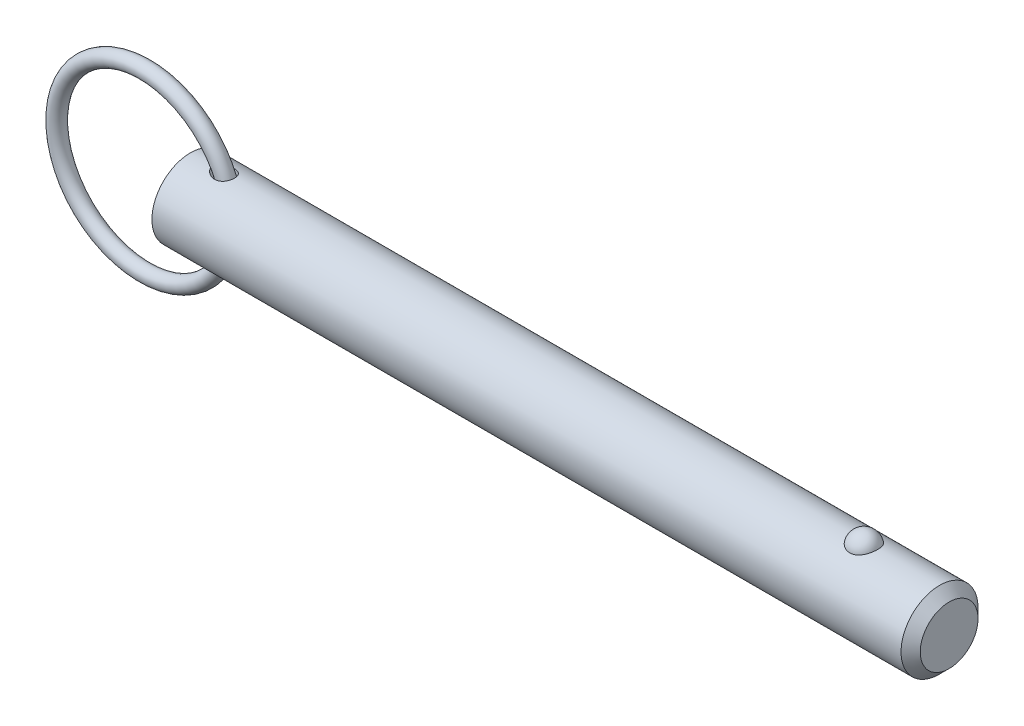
ISO-10303-21;
HEADER;
FILE_DESCRIPTION(('STEP AP214'),'2;1');
FILE_NAME('part.step','',(''),(''),'','','');
FILE_SCHEMA(('AUTOMOTIVE_DESIGN { 1 0 10303 214 1 1 1 1 }'));
ENDSEC;
DATA;
#1=APPLICATION_CONTEXT('core data for automotive mechanical design processes');
#2=APPLICATION_PROTOCOL_DEFINITION('international standard','automotive_design',2000,#1);
#3=PRODUCT_CONTEXT('',#1,'mechanical');
#4=PRODUCT('Part','Part','',(#3));
#5=PRODUCT_RELATED_PRODUCT_CATEGORY('part','',(#4));
#6=PRODUCT_DEFINITION_FORMATION('','',#4);
#7=PRODUCT_DEFINITION_CONTEXT('part definition',#1,'design');
#8=PRODUCT_DEFINITION('design','',#6,#7);
#9=PRODUCT_DEFINITION_SHAPE('','',#8);
#10=(LENGTH_UNIT() NAMED_UNIT(*) SI_UNIT(.MILLI.,.METRE.));
#11=(NAMED_UNIT(*) PLANE_ANGLE_UNIT() SI_UNIT($,.RADIAN.));
#12=(NAMED_UNIT(*) SI_UNIT($,.STERADIAN.) SOLID_ANGLE_UNIT());
#13=UNCERTAINTY_MEASURE_WITH_UNIT(LENGTH_MEASURE(1.E-05),#10,'distance_accuracy_value','');
#14=(GEOMETRIC_REPRESENTATION_CONTEXT(3) GLOBAL_UNCERTAINTY_ASSIGNED_CONTEXT((#13)) GLOBAL_UNIT_ASSIGNED_CONTEXT((#10,
#11,#12)) REPRESENTATION_CONTEXT('',''));
#15=CARTESIAN_POINT('',(0.,0.,0.));
#16=DIRECTION('',(0.,0.,1.));
#17=DIRECTION('',(1.,0.,0.));
#18=AXIS2_PLACEMENT_3D('',#15,#16,#17);
#19=CARTESIAN_POINT('',(-6.5973878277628,0.,0.));
#20=DIRECTION('',(0.,0.,1.));
#21=DIRECTION('',(1.,0.,0.));
#22=AXIS2_PLACEMENT_3D('',#19,#20,#21);
#23=TOROIDAL_SURFACE('',#22,12.7,1.111);
#24=CARTESIAN_POINT('',(7.21361217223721,0.,0.));
#25=VERTEX_POINT('',#24);
#26=VERTEX_LOOP('',#25);
#27=FACE_BOUND('',#26,.T.);
#28=ADVANCED_FACE('P0_F12',(#27),#23,.T.);
#29=CLOSED_SHELL('',(#28));
#30=MANIFOLD_SOLID_BREP('P0_B1',#29);
#31=CARTESIAN_POINT('',(0.,0.,0.));
#32=DIRECTION('',(1.,0.,0.));
#33=DIRECTION('',(0.,0.,-1.));
#34=AXIS2_PLACEMENT_3D('',#31,#32,#33);
#35=CYLINDRICAL_SURFACE('',#34,5.555);
#36=CARTESIAN_POINT('',(3.4079629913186,5.52646850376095,-0.56229074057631));
#37=CARTESIAN_POINT('',(3.45038002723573,5.51879026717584,-0.637753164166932));
#38=CARTESIAN_POINT('',(3.50032814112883,5.50998541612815,-0.70889136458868));
#39=CARTESIAN_POINT('',(3.61174203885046,5.49132550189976,-0.841353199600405));
#40=CARTESIAN_POINT('',(3.67323300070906,5.48146816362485,-0.902654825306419));
#41=CARTESIAN_POINT('',(3.80437942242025,5.46186986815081,-1.01449227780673));
#42=CARTESIAN_POINT('',(3.87396236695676,5.45212862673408,-1.06511378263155));
#43=CARTESIAN_POINT('',(4.01965973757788,5.43359578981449,-1.15594541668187));
#44=CARTESIAN_POINT('',(4.09577226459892,5.42480391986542,-1.19615855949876));
#45=CARTESIAN_POINT('',(4.26620236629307,5.40764958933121,-1.27165209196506));
#46=CARTESIAN_POINT('',(4.36143030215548,5.3996073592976,-1.30496908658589));
#47=CARTESIAN_POINT('',(4.55632904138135,5.38707461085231,-1.35578120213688));
#48=CARTESIAN_POINT('',(4.65600230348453,5.38258608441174,-1.37326745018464));
#49=CARTESIAN_POINT('',(4.85802759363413,5.37803111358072,-1.3910078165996));
#50=CARTESIAN_POINT('',(4.96039620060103,5.37800782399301,-1.39109376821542));
#51=CARTESIAN_POINT('',(5.16321961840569,5.38288845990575,-1.37209481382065));
#52=CARTESIAN_POINT('',(5.26367660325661,5.38778639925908,-1.3530331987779));
#53=CARTESIAN_POINT('',(5.44616808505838,5.40112654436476,-1.29866014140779));
#54=CARTESIAN_POINT('',(5.52893514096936,5.40904875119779,-1.26567968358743));
#55=CARTESIAN_POINT('',(5.68656142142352,5.4273273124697,-1.18484144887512));
#56=CARTESIAN_POINT('',(5.76142575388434,5.43768208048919,-1.13699336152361));
#57=CARTESIAN_POINT('',(5.8928378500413,5.45821422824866,-1.03362464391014));
#58=CARTESIAN_POINT('',(5.95048930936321,5.4682911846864,-0.979480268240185));
#59=CARTESIAN_POINT('',(6.05543937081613,5.48805232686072,-0.861887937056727));
#60=CARTESIAN_POINT('',(6.10274018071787,5.4977365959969,-0.798441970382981));
#61=CARTESIAN_POINT('',(6.18429732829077,5.51527779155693,-0.666351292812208));
#62=CARTESIAN_POINT('',(6.21893047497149,5.52318421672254,-0.597945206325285));
#63=CARTESIAN_POINT('',(6.27643902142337,5.53669785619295,-0.456146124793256));
#64=CARTESIAN_POINT('',(6.299314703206,5.54230512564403,-0.382753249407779));
#65=CARTESIAN_POINT('',(6.33280284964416,5.55061821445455,-0.232999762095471));
#66=CARTESIAN_POINT('',(6.34340498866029,5.55332159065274,-0.156636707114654));
#67=CARTESIAN_POINT('',(6.35208224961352,5.55552923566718,-0.00315477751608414));
#68=CARTESIAN_POINT('',(6.3501570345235,5.55503341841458,0.0739641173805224));
#69=CARTESIAN_POINT('',(6.33379320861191,5.55088854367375,0.22702996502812));
#70=CARTESIAN_POINT('',(6.31931424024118,5.54722931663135,0.302972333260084));
#71=CARTESIAN_POINT('',(6.27810810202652,5.53713917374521,0.451265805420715));
#72=CARTESIAN_POINT('',(6.25138106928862,5.53070828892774,0.523616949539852));
#73=CARTESIAN_POINT('',(6.18634700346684,5.51578851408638,0.662556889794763));
#74=CARTESIAN_POINT('',(6.14805666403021,5.50730259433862,0.729153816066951));
#75=CARTESIAN_POINT('',(6.0608417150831,5.4892059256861,0.854797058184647));
#76=CARTESIAN_POINT('',(6.01191805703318,5.47959527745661,0.91384404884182));
#77=CARTESIAN_POINT('',(5.90496974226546,5.46035411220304,1.0225462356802));
#78=CARTESIAN_POINT('',(5.8469816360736,5.45072382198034,1.07223745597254));
#79=CARTESIAN_POINT('',(5.72342907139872,5.43245016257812,1.16128533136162));
#80=CARTESIAN_POINT('',(5.65786492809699,5.42380675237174,1.20064241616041));
#81=CARTESIAN_POINT('',(5.52033184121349,5.40830592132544,1.26865612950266));
#82=CARTESIAN_POINT('',(5.44830127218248,5.40146883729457,1.29719236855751));
#83=CARTESIAN_POINT('',(5.30051649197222,5.39032432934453,1.34275086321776));
#84=CARTESIAN_POINT('',(5.22476137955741,5.38601752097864,1.35977031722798));
#85=CARTESIAN_POINT('',(5.06697568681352,5.38004503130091,1.3832203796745));
#86=CARTESIAN_POINT('',(4.98483834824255,5.37854992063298,1.38896799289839));
#87=CARTESIAN_POINT('',(4.82062075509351,5.37866467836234,1.38851901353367));
#88=CARTESIAN_POINT('',(4.73854053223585,5.38027567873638,1.38231806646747));
#89=CARTESIAN_POINT('',(4.5665970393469,5.38661928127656,1.35740374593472));
#90=CARTESIAN_POINT('',(4.47694676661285,5.39169506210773,1.33731128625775));
#91=CARTESIAN_POINT('',(4.30168169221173,5.40457769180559,1.28425210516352));
#92=CARTESIAN_POINT('',(4.2160714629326,5.41238755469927,1.25127117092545));
#93=CARTESIAN_POINT('',(4.04117722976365,5.43085841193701,1.16867508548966));
#94=CARTESIAN_POINT('',(3.95261220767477,5.44174460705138,1.11757796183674));
#95=CARTESIAN_POINT('',(3.78568183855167,5.46440376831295,1.00091858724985));
#96=CARTESIAN_POINT('',(3.70730710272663,5.47617590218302,0.935369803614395));
#97=CARTESIAN_POINT('',(3.5829937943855,5.49603821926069,0.809043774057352));
#98=CARTESIAN_POINT('',(3.5339020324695,5.50429522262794,0.751392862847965));
#99=CARTESIAN_POINT('',(3.44556991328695,5.51963490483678,0.628847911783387));
#100=CARTESIAN_POINT('',(3.40631385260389,5.52671944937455,0.563965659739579));
#101=CARTESIAN_POINT('',(3.34553998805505,5.5379053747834,0.439181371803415));
#102=CARTESIAN_POINT('',(3.32216705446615,5.5423057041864,0.380214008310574));
#103=CARTESIAN_POINT('',(3.2854368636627,5.54928356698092,0.259119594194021));
#104=CARTESIAN_POINT('',(3.27207322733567,5.5518622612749,0.196994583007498));
#105=CARTESIAN_POINT('',(3.25633559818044,5.5549036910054,0.0710541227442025));
#106=CARTESIAN_POINT('',(3.25400356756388,5.5553583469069,0.00723314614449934));
#107=CARTESIAN_POINT('',(3.26064251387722,5.55407150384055,-0.119787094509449));
#108=CARTESIAN_POINT('',(3.26961302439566,5.55233009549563,-0.182986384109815));
#109=CARTESIAN_POINT('',(3.29666795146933,5.54714559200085,-0.30051820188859));
#110=CARTESIAN_POINT('',(3.31373453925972,5.54389322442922,-0.355099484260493));
#111=CARTESIAN_POINT('',(3.35543396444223,5.53607951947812,-0.461174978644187));
#112=CARTESIAN_POINT('',(3.38007019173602,5.5315175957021,-0.512667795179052));
#113=CARTESIAN_POINT('',(3.4079629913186,5.52646850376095,-0.56229074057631));
#114=B_SPLINE_CURVE_WITH_KNOTS('',3,(#36,#37,#38,#39,#40,#41,#42,#43,#44,#45,#46,#47,#48,#49,
#50,#51,#52,#53,#54,#55,#56,#57,#58,#59,#60,#61,#62,#63,#64,#65,#66,#67,#68,#69,#70,#71,#72,#73,
#74,#75,#76,#77,#78,#79,#80,#81,#82,#83,#84,#85,#86,#87,#88,#89,#90,#91,#92,#93,#94,#95,#96,#97,
#98,#99,#100,#101,#102,#103,#104,#105,#106,#107,#108,#109,#110,#111,#112,#113),.UNSPECIFIED.,
.T.,.F.,(4,2,2,2,2,2,2,2,2,2,2,2,2,2,2,2,2,2,2,2,2,2,2,2,2,2,2,2,2,2,2,2,2,2,2,2,2,2,4),(0.,
0.260459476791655,0.521493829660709,0.780346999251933,1.03912513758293,1.34137402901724,
1.64379222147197,1.94913302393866,2.25410286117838,2.52092363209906,2.78757087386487,
3.0255756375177,3.26352958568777,3.49368251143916,3.72382991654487,3.9541708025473,
4.18451788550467,4.41560824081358,4.64669600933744,4.87745174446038,5.10818684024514,
5.33801446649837,5.56783253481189,5.80013729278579,6.03249854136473,6.27855081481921,
6.5246927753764,6.79963372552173,7.07487872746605,7.38193573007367,7.68870779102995,
7.91639390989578,8.14371416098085,8.33366541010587,8.52349549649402,8.71404708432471,
8.90459080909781,9.07578823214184,9.24706243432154),.UNSPECIFIED.);
#115=CARTESIAN_POINT('',(3.4079629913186,5.52646850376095,-0.56229074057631));
#116=VERTEX_POINT('',#115);
#117=EDGE_CURVE('P1_E40',#116,#116,#114,.T.);
#118=ORIENTED_EDGE('',*,*,#117,.T.);
#119=EDGE_LOOP('',(#118));
#120=FACE_BOUND('',#119,.T.);
#121=CARTESIAN_POINT('',(108.13125,0.,0.));
#122=DIRECTION('',(1.,0.,0.));
#123=DIRECTION('',(0.,0.,-1.));
#124=AXIS2_PLACEMENT_3D('',#121,#122,#123);
#125=CIRCLE('',#124,5.555);
#126=CARTESIAN_POINT('',(108.13125,0.,-5.555));
#127=VERTEX_POINT('',#126);
#128=EDGE_CURVE('P1_E25',#127,#127,#125,.T.);
#129=ORIENTED_EDGE('',*,*,#128,.F.);
#130=EDGE_LOOP('',(#129));
#131=FACE_BOUND('',#130,.T.);
#132=CARTESIAN_POINT('',(0.,0.,0.));
#133=DIRECTION('',(1.,0.,0.));
#134=DIRECTION('',(0.,0.,-1.));
#135=AXIS2_PLACEMENT_3D('',#132,#133,#134);
#136=CIRCLE('',#135,5.555);
#137=CARTESIAN_POINT('',(0.,0.,-5.555));
#138=VERTEX_POINT('',#137);
#139=EDGE_CURVE('P1_E9',#138,#138,#136,.T.);
#140=ORIENTED_EDGE('',*,*,#139,.T.);
#141=EDGE_LOOP('',(#140));
#142=FACE_BOUND('',#141,.T.);
#143=CARTESIAN_POINT('',(97.2186264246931,5.16741224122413,2.03859650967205));
#144=CARTESIAN_POINT('',(97.1129492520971,5.16740893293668,2.03859990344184));
#145=CARTESIAN_POINT('',(97.00729894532,5.17079470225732,2.03008306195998));
#146=CARTESIAN_POINT('',(96.7991419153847,5.18392795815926,1.9963072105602));
#147=CARTESIAN_POINT('',(96.6966344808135,5.19367399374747,1.9710520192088));
#148=CARTESIAN_POINT('',(96.4977710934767,5.21839168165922,1.90463997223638));
#149=CARTESIAN_POINT('',(96.4014064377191,5.23335573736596,1.86350622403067));
#150=CARTESIAN_POINT('',(96.2170804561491,5.26688076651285,1.76652592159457));
#151=CARTESIAN_POINT('',(96.1291207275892,5.28544242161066,1.71067657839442));
#152=CARTESIAN_POINT('',(95.9612654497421,5.32479845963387,1.58399959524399));
#153=CARTESIAN_POINT('',(95.8816656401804,5.34564089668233,1.51279545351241));
#154=CARTESIAN_POINT('',(95.7351290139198,5.38697258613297,1.35828584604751));
#155=CARTESIAN_POINT('',(95.668194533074,5.40746177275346,1.27497815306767));
#156=CARTESIAN_POINT('',(95.5456103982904,5.44694508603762,1.09440293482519));
#157=CARTESIAN_POINT('',(95.4905989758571,5.46583143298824,0.99667783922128));
#158=CARTESIAN_POINT('',(95.3969376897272,5.49908030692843,0.792961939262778));
#159=CARTESIAN_POINT('',(95.3582894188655,5.513442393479,0.686970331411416));
#160=CARTESIAN_POINT('',(95.2976807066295,5.536358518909,0.468019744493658));
#161=CARTESIAN_POINT('',(95.2759725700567,5.54482455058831,0.35498154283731));
#162=CARTESIAN_POINT('',(95.2506362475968,5.55473324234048,0.126595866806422));
#163=CARTESIAN_POINT('',(95.2470077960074,5.55617600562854,0.0112484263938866));
#164=CARTESIAN_POINT('',(95.2578817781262,5.55189984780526,-0.218011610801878));
#165=CARTESIAN_POINT('',(95.2723151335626,5.54620821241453,-0.331928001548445));
#166=CARTESIAN_POINT('',(95.318903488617,5.52828920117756,-0.555544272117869));
#167=CARTESIAN_POINT('',(95.3510588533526,5.5160616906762,-0.665244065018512));
#168=CARTESIAN_POINT('',(95.4324883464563,5.48630779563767,-0.877469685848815));
#169=CARTESIAN_POINT('',(95.4817816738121,5.4687754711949,-0.979987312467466));
#170=CARTESIAN_POINT('',(95.5964785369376,5.43024700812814,-1.17486975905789));
#171=CARTESIAN_POINT('',(95.6618831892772,5.4092506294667,-1.26723387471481));
#172=CARTESIAN_POINT('',(95.8075712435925,5.36600927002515,-1.43940133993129));
#173=CARTESIAN_POINT('',(95.8878859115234,5.34376173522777,-1.5191776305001));
#174=CARTESIAN_POINT('',(96.0614520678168,5.30057971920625,-1.66360338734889));
#175=CARTESIAN_POINT('',(96.1547021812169,5.27964509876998,-1.72825445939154));
#176=CARTESIAN_POINT('',(96.3493939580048,5.24205250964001,-1.8390947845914));
#177=CARTESIAN_POINT('',(96.4505900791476,5.22530519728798,-1.88568407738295));
#178=CARTESIAN_POINT('',(96.6601552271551,5.19750919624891,-1.96100802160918));
#179=CARTESIAN_POINT('',(96.7685215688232,5.18645838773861,-1.98974931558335));
#180=CARTESIAN_POINT('',(96.9834989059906,5.17184410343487,-2.02742262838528));
#181=CARTESIAN_POINT('',(97.089925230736,5.16793282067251,-2.0372760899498));
#182=CARTESIAN_POINT('',(97.3029925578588,5.1669899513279,-2.03966777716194));
#183=CARTESIAN_POINT('',(97.4096335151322,5.16995704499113,-2.03220932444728));
#184=CARTESIAN_POINT('',(97.6167730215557,5.18222383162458,-2.0007117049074));
#185=CARTESIAN_POINT('',(97.7173599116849,5.19133213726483,-1.97717337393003));
#186=CARTESIAN_POINT('',(97.9130141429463,5.21467637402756,-1.91475248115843));
#187=CARTESIAN_POINT('',(98.0080810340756,5.22891272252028,-1.8758686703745));
#188=CARTESIAN_POINT('',(98.1923711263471,5.26137066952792,-1.78282713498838));
#189=CARTESIAN_POINT('',(98.2814190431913,5.27967329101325,-1.7283512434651));
#190=CARTESIAN_POINT('',(98.4492880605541,5.31817411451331,-1.60597483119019));
#191=CARTESIAN_POINT('',(98.5281068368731,5.33837274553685,-1.53807126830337));
#192=CARTESIAN_POINT('',(98.6775156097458,5.37968287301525,-1.38688970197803));
#193=CARTESIAN_POINT('',(98.7475058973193,5.40079011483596,-1.30301744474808));
#194=CARTESIAN_POINT('',(98.8730125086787,5.44074401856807,-1.12458170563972));
#195=CARTESIAN_POINT('',(98.9285262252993,5.4595902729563,-1.03001630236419));
#196=CARTESIAN_POINT('',(99.0255507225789,5.49369849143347,-0.829439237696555));
#197=CARTESIAN_POINT('',(99.0665483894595,5.50882422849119,-0.723155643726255));
#198=CARTESIAN_POINT('',(99.1311250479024,5.53310911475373,-0.504772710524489));
#199=CARTESIAN_POINT('',(99.1547036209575,5.54226812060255,-0.392673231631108));
#200=CARTESIAN_POINT('',(99.184013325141,5.55370358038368,-0.165459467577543));
#201=CARTESIAN_POINT('',(99.1896884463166,5.55595843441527,-0.0503368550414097));
#202=CARTESIAN_POINT('',(99.182916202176,5.55329317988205,0.179288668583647));
#203=CARTESIAN_POINT('',(99.1704690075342,5.54837313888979,0.293791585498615));
#204=CARTESIAN_POINT('',(99.1277798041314,5.53189037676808,0.518526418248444));
#205=CARTESIAN_POINT('',(99.097598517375,5.5203503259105,0.62877154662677));
#206=CARTESIAN_POINT('',(99.0200962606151,5.49182453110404,0.84231815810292));
#207=CARTESIAN_POINT('',(98.9727743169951,5.47483847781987,0.945619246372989));
#208=CARTESIAN_POINT('',(98.8617204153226,5.43710633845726,1.14281571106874));
#209=CARTESIAN_POINT('',(98.7979215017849,5.41634501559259,1.23667048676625));
#210=CARTESIAN_POINT('',(98.6553577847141,5.37334572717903,1.4118524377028));
#211=CARTESIAN_POINT('',(98.5765932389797,5.35110778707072,1.49317982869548));
#212=CARTESIAN_POINT('',(98.4064234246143,5.30779474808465,1.64049162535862));
#213=CARTESIAN_POINT('',(98.3151002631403,5.28671324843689,1.70656877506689));
#214=CARTESIAN_POINT('',(98.1217390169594,5.2480485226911,1.82201372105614));
#215=CARTESIAN_POINT('',(98.0197005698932,5.23046541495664,1.87138095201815));
#216=CARTESIAN_POINT('',(97.8036187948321,5.20042692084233,1.95335298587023));
#217=CARTESIAN_POINT('',(97.689260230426,5.18820192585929,1.98521734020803));
#218=CARTESIAN_POINT('',(97.4561307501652,5.17169804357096,2.02783294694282));
#219=CARTESIAN_POINT('',(97.3373616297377,5.16741595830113,2.03859269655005));
#220=CARTESIAN_POINT('',(97.2186264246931,5.16741224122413,2.03859650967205));
#221=B_SPLINE_CURVE_WITH_KNOTS('',3,(#143,#144,#145,#146,#147,#148,#149,#150,#151,#152,#153,
#154,#155,#156,#157,#158,#159,#160,#161,#162,#163,#164,#165,#166,#167,#168,#169,#170,#171,#172,
#173,#174,#175,#176,#177,#178,#179,#180,#181,#182,#183,#184,#185,#186,#187,#188,#189,#190,#191,
#192,#193,#194,#195,#196,#197,#198,#199,#200,#201,#202,#203,#204,#205,#206,#207,#208,#209,#210,
#211,#212,#213,#214,#215,#216,#217,#218,#219,#220),.UNSPECIFIED.,.T.,.F.,(4,2,2,2,2,2,2,2,2,2,2,
2,2,2,2,2,2,2,2,2,2,2,2,2,2,2,2,2,2,2,2,2,2,2,2,2,2,2,4),(0.,0.316595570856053,
0.633118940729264,0.949183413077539,1.26530783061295,1.59030762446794,1.91536729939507,
2.25495824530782,2.59458224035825,2.93917283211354,3.28375835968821,3.62703002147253,
3.97030875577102,4.31397329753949,4.65766166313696,5.00207904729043,5.3464598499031,
5.68270547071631,6.0188258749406,6.33808403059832,6.65728093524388,6.96696376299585,
7.27667180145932,7.59321535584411,7.90983070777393,8.24210387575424,8.57443684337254,
8.91755896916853,9.26068933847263,9.60489211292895,9.949091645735,10.2921194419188,
10.6351667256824,10.9796305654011,11.324088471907,11.666392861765,12.0087088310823,
12.3645679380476,12.7202837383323),.UNSPECIFIED.);
#222=CARTESIAN_POINT('',(97.2186264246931,5.16741224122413,2.03859650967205));
#223=VERTEX_POINT('',#222);
#224=EDGE_CURVE('P1_E34',#223,#223,#221,.T.);
#225=ORIENTED_EDGE('',*,*,#224,.T.);
#226=EDGE_LOOP('',(#225));
#227=FACE_BOUND('',#226,.T.);
#228=CARTESIAN_POINT('',(3.4079629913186,-5.52646850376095,-0.56229074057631));
#229=CARTESIAN_POINT('',(3.37716927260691,-5.53204268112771,-0.507507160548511));
#230=CARTESIAN_POINT('',(3.35034276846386,-5.53702335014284,-0.450440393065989));
#231=CARTESIAN_POINT('',(3.30606625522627,-5.54534377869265,-0.3326552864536));
#232=CARTESIAN_POINT('',(3.28860803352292,-5.5486849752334,-0.271940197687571));
#233=CARTESIAN_POINT('',(3.26421203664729,-5.55337514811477,-0.148013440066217));
#234=CARTESIAN_POINT('',(3.25732647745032,-5.55471423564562,-0.0847909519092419));
#235=CARTESIAN_POINT('',(3.25480623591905,-5.5552029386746,0.0418913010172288));
#236=CARTESIAN_POINT('',(3.25917102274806,-5.55435265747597,0.105351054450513));
#237=CARTESIAN_POINT('',(3.27824306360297,-5.55067444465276,0.227039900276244));
#238=CARTESIAN_POINT('',(3.29237198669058,-5.54795714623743,0.285365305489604));
#239=CARTESIAN_POINT('',(3.32941044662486,-5.54094262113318,0.399033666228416));
#240=CARTESIAN_POINT('',(3.3523223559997,-5.53664496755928,0.454375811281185));
#241=CARTESIAN_POINT('',(3.40768868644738,-5.52648234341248,0.56509977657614));
#242=CARTESIAN_POINT('',(3.44072521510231,-5.52052470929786,0.620179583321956));
#243=CARTESIAN_POINT('',(3.51400705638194,-5.50771567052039,0.725188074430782));
#244=CARTESIAN_POINT('',(3.55425830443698,-5.50086353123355,0.775112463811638));
#245=CARTESIAN_POINT('',(3.66122818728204,-5.48337209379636,0.891977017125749));
#246=CARTESIAN_POINT('',(3.73142715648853,-5.47248221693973,0.955709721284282));
#247=CARTESIAN_POINT('',(3.88137100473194,-5.45112279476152,1.07085228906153));
#248=CARTESIAN_POINT('',(3.96113047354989,-5.44065392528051,1.12224294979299));
#249=CARTESIAN_POINT('',(4.12858826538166,-5.42121387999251,1.21269344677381));
#250=CARTESIAN_POINT('',(4.21635930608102,-5.41225908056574,1.25162207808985));
#251=CARTESIAN_POINT('',(4.39702156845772,-5.39704895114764,1.31566440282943));
#252=CARTESIAN_POINT('',(4.48991226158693,-5.39079334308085,1.34077951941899));
#253=CARTESIAN_POINT('',(4.68604255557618,-5.38154547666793,1.37745897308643));
#254=CARTESIAN_POINT('',(4.78952677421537,-5.37884317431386,1.38782444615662));
#255=CARTESIAN_POINT('',(4.9967070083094,-5.3783992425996,1.38955482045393));
#256=CARTESIAN_POINT('',(5.10040282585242,-5.380654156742,1.380932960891));
#257=CARTESIAN_POINT('',(5.29344112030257,-5.3896561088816,1.34533259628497));
#258=CARTESIAN_POINT('',(5.38316618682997,-5.39591960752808,1.32032381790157));
#259=CARTESIAN_POINT('',(5.55593681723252,-5.41176992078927,1.25376768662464));
#260=CARTESIAN_POINT('',(5.63898852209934,-5.42135363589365,1.2122357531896));
#261=CARTESIAN_POINT('',(5.78518175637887,-5.4411584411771,1.1197110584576));
#262=CARTESIAN_POINT('',(5.84951468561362,-5.45115126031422,1.07054233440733));
#263=CARTESIAN_POINT('',(5.96832363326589,-5.47143247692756,0.961516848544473));
#264=CARTESIAN_POINT('',(6.02280238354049,-5.48172079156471,0.901663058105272));
#265=CARTESIAN_POINT('',(6.11773365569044,-5.50082367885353,0.776380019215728));
#266=CARTESIAN_POINT('',(6.15876077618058,-5.50968670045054,0.711392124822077));
#267=CARTESIAN_POINT('',(6.22940016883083,-5.52555592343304,0.575278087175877));
#268=CARTESIAN_POINT('',(6.25901321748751,-5.53256225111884,0.504152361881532));
#269=CARTESIAN_POINT('',(6.30603044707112,-5.54392803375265,0.358090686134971));
#270=CARTESIAN_POINT('',(6.32348246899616,-5.54829785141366,0.283170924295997));
#271=CARTESIAN_POINT('',(6.34598368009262,-5.5539654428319,0.131376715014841));
#272=CARTESIAN_POINT('',(6.35103253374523,-5.55526313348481,0.054502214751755));
#273=CARTESIAN_POINT('',(6.34861245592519,-5.55464639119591,-0.0993401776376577));
#274=CARTESIAN_POINT('',(6.34109421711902,-5.5527193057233,-0.176307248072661));
#275=CARTESIAN_POINT('',(6.31360904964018,-5.54583593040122,-0.327847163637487));
#276=CARTESIAN_POINT('',(6.29364207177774,-5.54087962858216,-0.402419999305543));
#277=CARTESIAN_POINT('',(6.24170966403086,-5.52847553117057,-0.547041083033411));
#278=CARTESIAN_POINT('',(6.20974488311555,-5.52102787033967,-0.617089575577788));
#279=CARTESIAN_POINT('',(6.13458425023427,-5.5044595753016,-0.750655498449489));
#280=CARTESIAN_POINT('',(6.09138916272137,-5.49533905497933,-0.814173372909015));
#281=CARTESIAN_POINT('',(5.99508306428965,-5.47647644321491,-0.932642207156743));
#282=CARTESIAN_POINT('',(5.94201288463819,-5.46673701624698,-0.987626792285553));
#283=CARTESIAN_POINT('',(5.82732079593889,-5.4476756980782,-1.08787197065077));
#284=CARTESIAN_POINT('',(5.76569959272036,-5.43835377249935,-1.133133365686));
#285=CARTESIAN_POINT('',(5.63545565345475,-5.42108746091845,-1.2130627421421));
#286=CARTESIAN_POINT('',(5.56680798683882,-5.41314827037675,-1.24769112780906));
#287=CARTESIAN_POINT('',(5.42470366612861,-5.39946749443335,-1.30562834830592));
#288=CARTESIAN_POINT('',(5.35124627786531,-5.39372624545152,-1.32893545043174));
#289=CARTESIAN_POINT('',(5.19834649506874,-5.38471871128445,-1.36498831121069));
#290=CARTESIAN_POINT('',(5.11878242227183,-5.38156800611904,-1.37724301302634));
#291=CARTESIAN_POINT('',(4.95867408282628,-5.37830368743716,-1.38993264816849));
#292=CARTESIAN_POINT('',(4.87812945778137,-5.37819121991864,-1.39036312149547));
#293=CARTESIAN_POINT('',(4.70952450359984,-5.38096665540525,-1.37958681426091));
#294=CARTESIAN_POINT('',(4.62154757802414,-5.38416579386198,-1.36717293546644));
#295=CARTESIAN_POINT('',(4.44844201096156,-5.39350862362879,-1.32983172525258));
#296=CARTESIAN_POINT('',(4.36331534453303,-5.39965431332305,-1.30489590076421));
#297=CARTESIAN_POINT('',(4.18705584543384,-5.41508127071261,-1.23943340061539));
#298=CARTESIAN_POINT('',(4.09653169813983,-5.42466147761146,-1.19732979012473));
#299=CARTESIAN_POINT('',(3.92355621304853,-5.44542654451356,-1.09903394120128));
#300=CARTESIAN_POINT('',(3.84111059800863,-5.45661252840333,-1.04283181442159));
#301=CARTESIAN_POINT('',(3.69303712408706,-5.47835672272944,-0.921492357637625));
#302=CARTESIAN_POINT('',(3.62661543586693,-5.4888999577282,-0.857326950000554));
#303=CARTESIAN_POINT('',(3.50663841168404,-5.50887375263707,-0.717815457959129));
#304=CARTESIAN_POINT('',(3.45304856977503,-5.51830726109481,-0.642500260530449));
#305=CARTESIAN_POINT('',(3.4079629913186,-5.52646850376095,-0.56229074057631));
#306=B_SPLINE_CURVE_WITH_KNOTS('',3,(#228,#229,#230,#231,#232,#233,#234,#235,#236,#237,#238,
#239,#240,#241,#242,#243,#244,#245,#246,#247,#248,#249,#250,#251,#252,#253,#254,#255,#256,#257,
#258,#259,#260,#261,#262,#263,#264,#265,#266,#267,#268,#269,#270,#271,#272,#273,#274,#275,#276,
#277,#278,#279,#280,#281,#282,#283,#284,#285,#286,#287,#288,#289,#290,#291,#292,#293,#294,#295,
#296,#297,#298,#299,#300,#301,#302,#303,#304,#305),.UNSPECIFIED.,.T.,.F.,(4,2,2,2,2,2,2,2,2,2,2,
2,2,2,2,2,2,2,2,2,2,2,2,2,2,2,2,2,2,2,2,2,2,2,2,2,2,2,4),(0.,0.189054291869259,
0.377942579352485,0.567760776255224,0.757570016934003,0.937004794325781,1.11648807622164,
1.30929480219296,1.50226088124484,1.78704908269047,2.07227755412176,2.3604171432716,
2.64852704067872,2.95892962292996,3.26911584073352,3.5475451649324,3.82571526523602,
4.06921935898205,4.31265584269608,4.54364944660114,4.77462733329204,5.00469135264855,
5.23476159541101,5.46573664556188,5.69671260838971,5.92767607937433,6.15862383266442,
6.38863707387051,6.61863134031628,6.84947196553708,7.08034790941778,7.32103794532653,
7.56181876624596,7.82747997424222,8.09332161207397,8.39289891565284,8.69268692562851,
8.97023931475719,9.24703674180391),.UNSPECIFIED.);
#307=CARTESIAN_POINT('',(3.4079629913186,-5.52646850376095,-0.56229074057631));
#308=VERTEX_POINT('',#307);
#309=EDGE_CURVE('P1_E17',#308,#308,#306,.T.);
#310=ORIENTED_EDGE('',*,*,#309,.T.);
#311=EDGE_LOOP('',(#310));
#312=FACE_BOUND('',#311,.T.);
#313=ADVANCED_FACE('P1_F13',(#120,#131,#142,#227,#312),#35,.T.);
#314=CARTESIAN_POINT('',(0.,0.,0.));
#315=DIRECTION('',(-1.,0.,0.));
#316=DIRECTION('',(0.,0.,1.));
#317=AXIS2_PLACEMENT_3D('',#314,#315,#316);
#318=PLANE('',#317);
#319=ORIENTED_EDGE('',*,*,#139,.F.);
#320=EDGE_LOOP('',(#319));
#321=FACE_BOUND('',#320,.T.);
#322=ADVANCED_FACE('P1_F15',(#321),#318,.T.);
#323=CARTESIAN_POINT('',(109.52,0.,0.));
#324=DIRECTION('',(-1.,0.,0.));
#325=DIRECTION('',(0.,0.,1.));
#326=AXIS2_PLACEMENT_3D('',#323,#324,#325);
#327=CONICAL_SURFACE('',#326,4.16625000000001,0.785398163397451);
#328=ORIENTED_EDGE('',*,*,#128,.T.);
#329=EDGE_LOOP('',(#328));
#330=FACE_BOUND('',#329,.T.);
#331=CARTESIAN_POINT('',(109.52,0.,0.));
#332=DIRECTION('',(1.,0.,0.));
#333=DIRECTION('',(0.,0.,-1.));
#334=AXIS2_PLACEMENT_3D('',#331,#332,#333);
#335=CIRCLE('',#334,4.16625000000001);
#336=CARTESIAN_POINT('',(109.52,0.,-4.16625000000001));
#337=VERTEX_POINT('',#336);
#338=EDGE_CURVE('P1_E30',#337,#337,#335,.T.);
#339=ORIENTED_EDGE('',*,*,#338,.F.);
#340=EDGE_LOOP('',(#339));
#341=FACE_BOUND('',#340,.T.);
#342=ADVANCED_FACE('P1_F55',(#330,#341),#327,.T.);
#343=CARTESIAN_POINT('',(109.52,4.16625000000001,0.));
#344=DIRECTION('',(1.,0.,0.));
#345=DIRECTION('',(0.,0.,-1.));
#346=AXIS2_PLACEMENT_3D('',#343,#344,#345);
#347=PLANE('',#346);
#348=ORIENTED_EDGE('',*,*,#338,.T.);
#349=EDGE_LOOP('',(#348));
#350=FACE_BOUND('',#349,.T.);
#351=ADVANCED_FACE('P1_F51',(#350),#347,.T.);
#352=CARTESIAN_POINT('',(97.2186264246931,4.9995,0.));
#353=DIRECTION('',(-1.,0.,0.));
#354=DIRECTION('',(0.,1.,0.));
#355=AXIS2_PLACEMENT_3D('',#352,#353,#354);
#356=SPHERICAL_SURFACE('',#355,2.04549999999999);
#357=ORIENTED_EDGE('',*,*,#224,.F.);
#358=EDGE_LOOP('',(#357));
#359=FACE_BOUND('',#358,.T.);
#360=ADVANCED_FACE('P1_F46',(#359),#356,.T.);
#361=CARTESIAN_POINT('',(-6.59738782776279,0.,0.));
#362=DIRECTION('',(0.,0.,1.));
#363=DIRECTION('',(1.,0.,0.));
#364=AXIS2_PLACEMENT_3D('',#361,#362,#363);
#365=TOROIDAL_SURFACE('',#364,12.7,1.38875);
#366=ORIENTED_EDGE('',*,*,#309,.F.);
#367=EDGE_LOOP('',(#366));
#368=FACE_BOUND('',#367,.T.);
#369=ORIENTED_EDGE('',*,*,#117,.F.);
#370=EDGE_LOOP('',(#369));
#371=FACE_BOUND('',#370,.T.);
#372=ADVANCED_FACE('P1_F50',(#368,#371),#365,.F.);
#373=CLOSED_SHELL('',(#313,#322,#342,#351,#360,#372));
#374=MANIFOLD_SOLID_BREP('P1_B1',#373);
#375=ADVANCED_BREP_SHAPE_REPRESENTATION('',(#18,#30,#374),#14);
#376=SHAPE_DEFINITION_REPRESENTATION(#9,#375);
ENDSEC;
END-ISO-10303-21;
